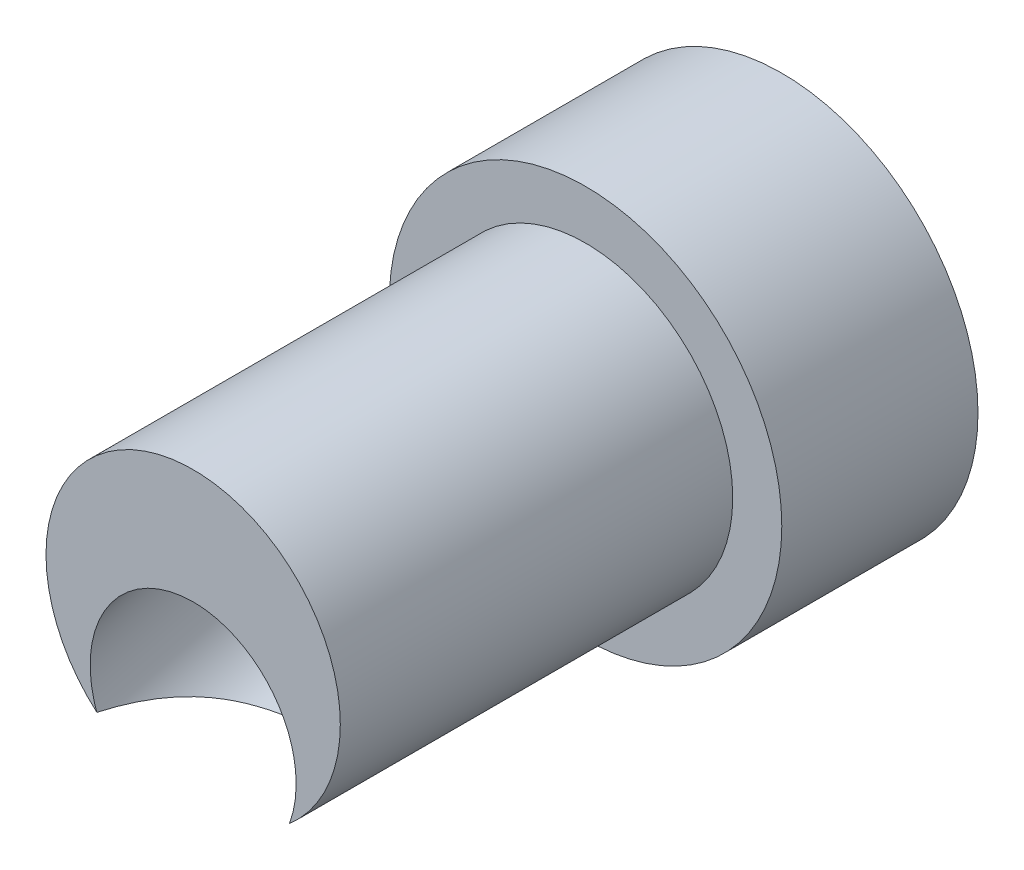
ISO-10303-21;
HEADER;
FILE_DESCRIPTION(('STEP AP214'),'2;1');
FILE_NAME('part.step','',(''),(''),'','','');
FILE_SCHEMA(('AUTOMOTIVE_DESIGN { 1 0 10303 214 1 1 1 1 }'));
ENDSEC;
DATA;
#1=APPLICATION_CONTEXT('core data for automotive mechanical design processes');
#2=APPLICATION_PROTOCOL_DEFINITION('international standard','automotive_design',2000,#1);
#3=PRODUCT_CONTEXT('',#1,'mechanical');
#4=PRODUCT('Part','Part','',(#3));
#5=PRODUCT_RELATED_PRODUCT_CATEGORY('part','',(#4));
#6=PRODUCT_DEFINITION_FORMATION('','',#4);
#7=PRODUCT_DEFINITION_CONTEXT('part definition',#1,'design');
#8=PRODUCT_DEFINITION('design','',#6,#7);
#9=PRODUCT_DEFINITION_SHAPE('','',#8);
#10=(LENGTH_UNIT() NAMED_UNIT(*) SI_UNIT(.MILLI.,.METRE.));
#11=(NAMED_UNIT(*) PLANE_ANGLE_UNIT() SI_UNIT($,.RADIAN.));
#12=(NAMED_UNIT(*) SI_UNIT($,.STERADIAN.) SOLID_ANGLE_UNIT());
#13=UNCERTAINTY_MEASURE_WITH_UNIT(LENGTH_MEASURE(1.E-05),#10,'distance_accuracy_value','');
#14=(GEOMETRIC_REPRESENTATION_CONTEXT(3) GLOBAL_UNCERTAINTY_ASSIGNED_CONTEXT((#13)) GLOBAL_UNIT_ASSIGNED_CONTEXT((#10,
#11,#12)) REPRESENTATION_CONTEXT('',''));
#15=CARTESIAN_POINT('',(0.,0.,0.));
#16=DIRECTION('',(0.,0.,1.));
#17=DIRECTION('',(1.,0.,0.));
#18=AXIS2_PLACEMENT_3D('',#15,#16,#17);
#19=CARTESIAN_POINT('',(0.,-2.,14.));
#20=DIRECTION('',(0.,0.242535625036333,-0.970142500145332));
#21=DIRECTION('',(0.,0.970142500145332,0.242535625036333));
#22=AXIS2_PLACEMENT_3D('',#19,#20,#21);
#23=CYLINDRICAL_SURFACE('',#22,2.1);
#24=CARTESIAN_POINT('',(0.,1.5,0.));
#25=DIRECTION('',(0.,0.,1.));
#26=DIRECTION('',(0.,1.,0.));
#27=AXIS2_PLACEMENT_3D('',#24,#25,#26);
#28=ELLIPSE('',#27,2.16463045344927,2.1);
#29=CARTESIAN_POINT('',(0.,3.66463045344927,0.));
#30=VERTEX_POINT('',#29);
#31=EDGE_CURVE('E68',#30,#30,#28,.F.);
#32=ORIENTED_EDGE('',*,*,#31,.T.);
#33=EDGE_LOOP('',(#32));
#34=FACE_BOUND('',#33,.T.);
#35=CARTESIAN_POINT('',(1.96322722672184,-2.26842210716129,12.));
#36=CARTESIAN_POINT('',(1.9554236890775,-2.27517414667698,11.9422989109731));
#37=CARTESIAN_POINT('',(1.9471359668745,-2.28227836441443,11.8847052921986));
#38=CARTESIAN_POINT('',(1.92946543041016,-2.29723706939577,11.7697727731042));
#39=CARTESIAN_POINT('',(1.92008239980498,-2.30509170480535,11.7124339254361));
#40=CARTESIAN_POINT('',(1.8900356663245,-2.32990324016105,11.5404962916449));
#41=CARTESIAN_POINT('',(1.86752676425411,-2.34806150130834,11.4263779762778));
#42=CARTESIAN_POINT('',(1.81581825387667,-2.38828413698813,11.1979168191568));
#43=CARTESIAN_POINT('',(1.7864960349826,-2.41041816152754,11.0836135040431));
#44=CARTESIAN_POINT('',(1.71968178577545,-2.45853624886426,10.8583596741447));
#45=CARTESIAN_POINT('',(1.68220259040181,-2.48451424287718,10.7474042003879));
#46=CARTESIAN_POINT('',(1.61723186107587,-2.52690707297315,10.5823206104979));
#47=CARTESIAN_POINT('',(1.59351679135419,-2.54196512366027,10.5263561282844));
#48=CARTESIAN_POINT('',(1.54289237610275,-2.57300677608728,10.4161559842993));
#49=CARTESIAN_POINT('',(1.51598265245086,-2.58899048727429,10.3619205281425));
#50=CARTESIAN_POINT('',(1.43015212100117,-2.63799674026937,10.2029043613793));
#51=CARTESIAN_POINT('',(1.36590543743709,-2.67222835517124,10.1012156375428));
#52=CARTESIAN_POINT('',(1.23360306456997,-2.73543009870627,9.92764996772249));
#53=CARTESIAN_POINT('',(1.16824142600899,-2.76425724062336,9.85368379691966));
#54=CARTESIAN_POINT('',(1.02550603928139,-2.82031723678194,9.71752145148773));
#55=CARTESIAN_POINT('',(0.94814075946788,-2.84755119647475,9.65531704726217));
#56=CARTESIAN_POINT('',(0.796313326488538,-2.89327632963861,9.55518215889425));
#57=CARTESIAN_POINT('',(0.72360335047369,-2.912466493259,9.51492151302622));
#58=CARTESIAN_POINT('',(0.571726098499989,-2.94604198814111,9.44622354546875));
#59=CARTESIAN_POINT('',(0.492560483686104,-2.96042855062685,9.41778319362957));
#60=CARTESIAN_POINT('',(0.329521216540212,-2.98298643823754,9.37379532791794));
#61=CARTESIAN_POINT('',(0.245630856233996,-2.99113399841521,9.35829709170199));
#62=CARTESIAN_POINT('',(0.0760624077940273,-3.00023591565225,9.34100960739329));
#63=CARTESIAN_POINT('',(-0.0096153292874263,-3.00119167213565,9.33921769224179));
#64=CARTESIAN_POINT('',(-0.174120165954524,-2.9959970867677,9.34905623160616));
#65=CARTESIAN_POINT('',(-0.253018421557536,-2.99032336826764,9.35978635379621));
#66=CARTESIAN_POINT('',(-0.407674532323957,-2.97318942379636,9.39282505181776));
#67=CARTESIAN_POINT('',(-0.48343272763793,-2.96172982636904,9.41513236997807));
#68=CARTESIAN_POINT('',(-0.630791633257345,-2.93390457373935,9.47086115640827));
#69=CARTESIAN_POINT('',(-0.702333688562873,-2.91748336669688,9.50440896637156));
#70=CARTESIAN_POINT('',(-0.838914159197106,-2.88118502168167,9.58134046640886));
#71=CARTESIAN_POINT('',(-0.903950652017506,-2.86130686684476,9.62472705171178));
#72=CARTESIAN_POINT('',(-1.04948586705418,-2.81184600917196,9.73750572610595));
#73=CARTESIAN_POINT('',(-1.12683040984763,-2.78138961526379,9.81058548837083));
#74=CARTESIAN_POINT('',(-1.26793705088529,-2.71998193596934,9.96863935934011));
#75=CARTESIAN_POINT('',(-1.33167622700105,-2.68902990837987,10.0536331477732));
#76=CARTESIAN_POINT('',(-1.4333638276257,-2.63589217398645,10.2109867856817));
#77=CARTESIAN_POINT('',(-1.47385411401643,-2.61335427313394,10.2816286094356));
#78=CARTESIAN_POINT('',(-1.54857420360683,-2.56978445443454,10.4266275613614));
#79=CARTESIAN_POINT('',(-1.58280006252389,-2.54875349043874,10.5009869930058));
#80=CARTESIAN_POINT('',(-1.6459824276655,-2.50841603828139,10.6527472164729));
#81=CARTESIAN_POINT('',(-1.67491462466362,-2.48911770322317,10.7301601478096));
#82=CARTESIAN_POINT('',(-1.72816339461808,-2.45244682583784,10.8870083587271));
#83=CARTESIAN_POINT('',(-1.75247874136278,-2.43507479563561,10.9664441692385));
#84=CARTESIAN_POINT('',(-1.79662956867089,-2.40267579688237,11.1246913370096));
#85=CARTESIAN_POINT('',(-1.81656528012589,-2.38759951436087,11.203465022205));
#86=CARTESIAN_POINT('',(-1.8533131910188,-2.35918803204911,11.362054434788));
#87=CARTESIAN_POINT('',(-1.87012486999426,-2.34585312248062,11.4418703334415));
#88=CARTESIAN_POINT('',(-1.90088220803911,-2.32099866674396,11.6011287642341));
#89=CARTESIAN_POINT('',(-1.91486497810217,-2.30945614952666,11.6805606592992));
#90=CARTESIAN_POINT('',(-1.94061357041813,-2.287856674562,11.8399317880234));
#91=CARTESIAN_POINT('',(-1.95238083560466,-2.27779875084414,11.9198706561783));
#92=CARTESIAN_POINT('',(-1.96322722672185,-2.2684221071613,12.));
#93=B_SPLINE_CURVE_WITH_KNOTS('',3,(#35,#36,#37,#38,#39,#40,#41,#42,#43,#44,#45,#46,#47,#48,#49,
#50,#51,#52,#53,#54,#55,#56,#57,#58,#59,#60,#61,#62,#63,#64,#65,#66,#67,#68,#69,#70,#71,#72,#73,
#74,#75,#76,#77,#78,#79,#80,#81,#82,#83,#84,#85,#86,#87,#88,#89,#90,#91,#92),.UNSPECIFIED.,.F.,
.F.,(4,2,2,2,2,2,2,2,2,2,2,2,2,2,2,2,2,2,2,2,2,2,2,2,2,2,2,2,4),(0.,0.17584326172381,
0.351721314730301,0.704698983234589,1.06460229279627,1.42394333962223,1.61169789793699,
1.7994747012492,2.1730699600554,2.48043941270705,2.78759299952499,3.04240134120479,
3.29714432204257,3.55285288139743,3.80851168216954,4.04686527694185,4.28519298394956,
4.52629472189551,4.76746750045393,5.09766496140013,5.42841441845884,5.6815199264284,
5.93478425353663,6.1891839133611,6.44365104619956,6.69148686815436,6.9393639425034,
7.18374155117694,7.42795944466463),.UNSPECIFIED.);
#94=CARTESIAN_POINT('',(1.96322722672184,-2.26842210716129,12.));
#95=VERTEX_POINT('',#94);
#96=CARTESIAN_POINT('',(-1.96322722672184,-2.26842210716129,12.));
#97=VERTEX_POINT('',#96);
#98=EDGE_CURVE('E60',#95,#97,#93,.T.);
#99=ORIENTED_EDGE('',*,*,#98,.F.);
#100=CARTESIAN_POINT('',(0.,-1.5,12.));
#101=DIRECTION('',(0.,0.,1.));
#102=DIRECTION('',(0.,1.,0.));
#103=AXIS2_PLACEMENT_3D('',#100,#101,#102);
#104=ELLIPSE('',#103,2.16463045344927,2.1);
#105=EDGE_CURVE('E66',#97,#95,#104,.F.);
#106=ORIENTED_EDGE('',*,*,#105,.F.);
#107=EDGE_LOOP('',(#99,#106));
#108=FACE_BOUND('',#107,.T.);
#109=ADVANCED_FACE('F45',(#34,#108),#23,.F.);
#110=CARTESIAN_POINT('',(0.,0.,12.));
#111=DIRECTION('',(0.,0.,-1.));
#112=DIRECTION('',(-1.,0.,0.));
#113=AXIS2_PLACEMENT_3D('',#110,#111,#112);
#114=CYLINDRICAL_SURFACE('',#113,4.);
#115=CARTESIAN_POINT('',(0.,0.,0.));
#116=DIRECTION('',(0.,0.,1.));
#117=DIRECTION('',(1.,0.,0.));
#118=AXIS2_PLACEMENT_3D('',#115,#116,#117);
#119=CIRCLE('',#118,4.);
#120=CARTESIAN_POINT('',(4.,0.,0.));
#121=VERTEX_POINT('',#120);
#122=EDGE_CURVE('E54',#121,#121,#119,.T.);
#123=ORIENTED_EDGE('',*,*,#122,.T.);
#124=EDGE_LOOP('',(#123));
#125=FACE_BOUND('',#124,.T.);
#126=CARTESIAN_POINT('',(0.,0.,4.));
#127=DIRECTION('',(0.,0.,1.));
#128=DIRECTION('',(1.,0.,0.));
#129=AXIS2_PLACEMENT_3D('',#126,#127,#128);
#130=CIRCLE('',#129,4.);
#131=CARTESIAN_POINT('',(4.,0.,4.));
#132=VERTEX_POINT('',#131);
#133=EDGE_CURVE('E69',#132,#132,#130,.T.);
#134=ORIENTED_EDGE('',*,*,#133,.F.);
#135=EDGE_LOOP('',(#134));
#136=FACE_BOUND('',#135,.T.);
#137=ADVANCED_FACE('F95',(#125,#136),#114,.T.);
#138=CARTESIAN_POINT('',(0.,0.,12.));
#139=DIRECTION('',(0.,0.,1.));
#140=DIRECTION('',(1.,0.,0.));
#141=AXIS2_PLACEMENT_3D('',#138,#139,#140);
#142=PLANE('',#141);
#143=ORIENTED_EDGE('',*,*,#105,.T.);
#144=CARTESIAN_POINT('',(0.,0.,12.));
#145=DIRECTION('',(0.,0.,1.));
#146=DIRECTION('',(1.,0.,0.));
#147=AXIS2_PLACEMENT_3D('',#144,#145,#146);
#148=CIRCLE('',#147,3.);
#149=EDGE_CURVE('E12',#95,#97,#148,.T.);
#150=ORIENTED_EDGE('',*,*,#149,.T.);
#151=EDGE_LOOP('',(#143,#150));
#152=FACE_BOUND('',#151,.T.);
#153=ADVANCED_FACE('F71',(#152),#142,.T.);
#154=CARTESIAN_POINT('',(0.,0.,0.));
#155=DIRECTION('',(0.,0.,1.));
#156=DIRECTION('',(1.,0.,0.));
#157=AXIS2_PLACEMENT_3D('',#154,#155,#156);
#158=PLANE('',#157);
#159=ORIENTED_EDGE('',*,*,#31,.F.);
#160=EDGE_LOOP('',(#159));
#161=FACE_BOUND('',#160,.T.);
#162=ORIENTED_EDGE('',*,*,#122,.F.);
#163=EDGE_LOOP('',(#162));
#164=FACE_BOUND('',#163,.T.);
#165=ADVANCED_FACE('F90',(#161,#164),#158,.F.);
#166=CARTESIAN_POINT('',(0.,0.,4.));
#167=DIRECTION('',(0.,0.,1.));
#168=DIRECTION('',(1.,0.,0.));
#169=AXIS2_PLACEMENT_3D('',#166,#167,#168);
#170=CYLINDRICAL_SURFACE('',#169,3.);
#171=CARTESIAN_POINT('',(0.,0.,4.));
#172=DIRECTION('',(0.,0.,1.));
#173=DIRECTION('',(1.,0.,0.));
#174=AXIS2_PLACEMENT_3D('',#171,#172,#173);
#175=CIRCLE('',#174,3.);
#176=CARTESIAN_POINT('',(3.,0.,4.));
#177=VERTEX_POINT('',#176);
#178=EDGE_CURVE('E148',#177,#177,#175,.T.);
#179=ORIENTED_EDGE('',*,*,#178,.T.);
#180=EDGE_LOOP('',(#179));
#181=FACE_BOUND('',#180,.T.);
#182=ORIENTED_EDGE('',*,*,#98,.T.);
#183=ORIENTED_EDGE('',*,*,#149,.F.);
#184=EDGE_LOOP('',(#182,#183));
#185=FACE_BOUND('',#184,.T.);
#186=ADVANCED_FACE('F61',(#181,#185),#170,.T.);
#187=CARTESIAN_POINT('',(0.,0.,4.));
#188=DIRECTION('',(0.,0.,1.));
#189=DIRECTION('',(1.,0.,0.));
#190=AXIS2_PLACEMENT_3D('',#187,#188,#189);
#191=PLANE('',#190);
#192=ORIENTED_EDGE('',*,*,#178,.F.);
#193=EDGE_LOOP('',(#192));
#194=FACE_BOUND('',#193,.T.);
#195=ORIENTED_EDGE('',*,*,#133,.T.);
#196=EDGE_LOOP('',(#195));
#197=FACE_BOUND('',#196,.T.);
#198=ADVANCED_FACE('F89',(#194,#197),#191,.T.);
#199=CLOSED_SHELL('',(#109,#137,#153,#165,#186,#198));
#200=MANIFOLD_SOLID_BREP('B2',#199);
#201=ADVANCED_BREP_SHAPE_REPRESENTATION('',(#18,#200),#14);
#202=SHAPE_DEFINITION_REPRESENTATION(#9,#201);
ENDSEC;
END-ISO-10303-21;
